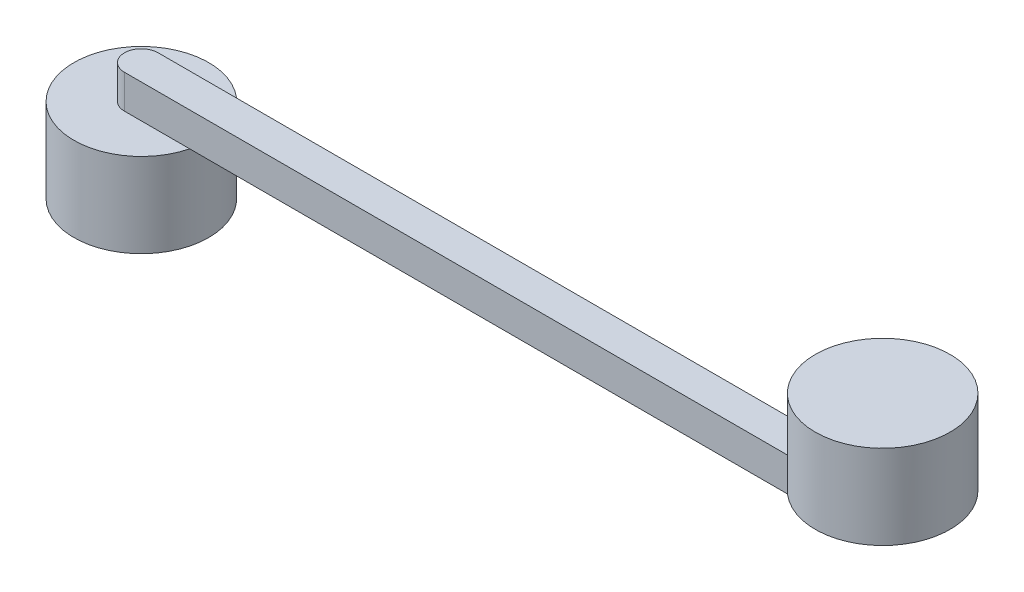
from build123d import *

# Parameters (mm, degrees)
EXTRUDE1_DEPTH = 12.7
SKETCH2_R      = 25.4
EXTRUDE2_DEPTH = 31.75
SKETCH3_R      = 25.4
EXTRUDE3_DEPTH = 31.75


with BuildPart() as part:
    # Sketch1 → Extrude1 (new body)
    with BuildSketch(Plane(origin=(0, 0, 0), x_dir=(1, 0, 0), z_dir=(0, 1, 0))):
        with BuildLine():
            Line((-139.7, 6.35), (139.7, 6.35))
            ThreePointArc((139.7, 6.35), (146.05, 0), (139.7, -6.35))
            Line((139.7, -6.35), (-139.7, -6.35))
            ThreePointArc((-139.7, -6.35), (-146.05, 0), (-139.7, 6.35))
        make_face()
    extrude(amount=EXTRUDE1_DEPTH)

    # Sketch2 → Extrude2 (add)
    with BuildSketch(Plane(origin=(0, 12.7, 0), x_dir=(1, 0, 0), z_dir=(0, 1, 0))):
        with Locations(Location((139.7, 0, 0), (0, 0, 165.522487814))):
            Circle(SKETCH2_R)
    extrude(amount=EXTRUDE2_DEPTH)

    # Sketch3 → Extrude3 (add)
    with BuildSketch(Plane.XZ):
        with Locations(Location((-139.7, 0, 0), (0, 0, 14.477512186))):
            Circle(SKETCH3_R)
    extrude(amount=EXTRUDE3_DEPTH)


solid = part.part
